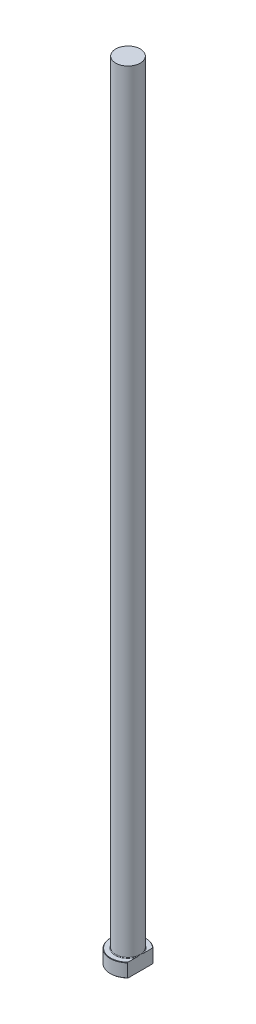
from build123d import *
from build123d.topology import SkipClean

# Parameters (mm, degrees)
CHAMFER1_SIZE = 0.2
FILLET1_R     = 0.3
KEY_DEPTH     = 401.202448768


with BuildPart() as part:
    # Sketch1 → Revolve1 (revolve)
    with BuildSketch(Plane.XY, mode=Mode.PRIVATE) as revolve1_sk:
        Polygon((0, 0), (-9, 0), (-9, 7), (-6.25, 7), (-6.25, 400), (0, 400), align=None)
    revolve(revolve1_sk.sketch.rotate(Axis((0, 259.958771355, 0), (0, -1, 0)), 270), axis=Axis((0, 259.958771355, 0), (0, -1, 0)))

    # Chamfer1
    chamfer1_edges = [part.edges().sort_by_distance(p)[0] for p in [
        (0, 7, -9),
        (0, 0, -9),
    ]]
    chamfer(chamfer1_edges, length=CHAMFER1_SIZE)

    # Fillet1
    fillet1_edges = [part.edges().sort_by_distance(p)[0] for p in [
        (0, 7, -6.25),
    ]]
    fillet(fillet1_edges, radius=FILLET1_R)

    # Sketch2 → KEY (cut, through all)
    with SkipClean():  # the faces are left unmerged after this step: merging them gives an invalid solid
        with BuildSketch(Plane(origin=(0, 0, 0), x_dir=(1, 0, 0), z_dir=(0, 1, 0))):
            with BuildLine():
                Line((6.25, 6.475916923), (6.25, -6.475916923))
                ThreePointArc((6.25, -6.475916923), (9, 0), (6.25, 6.475916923))
            make_face()
        extrude(amount=KEY_DEPTH, mode=Mode.SUBTRACT)


solid = part.part
